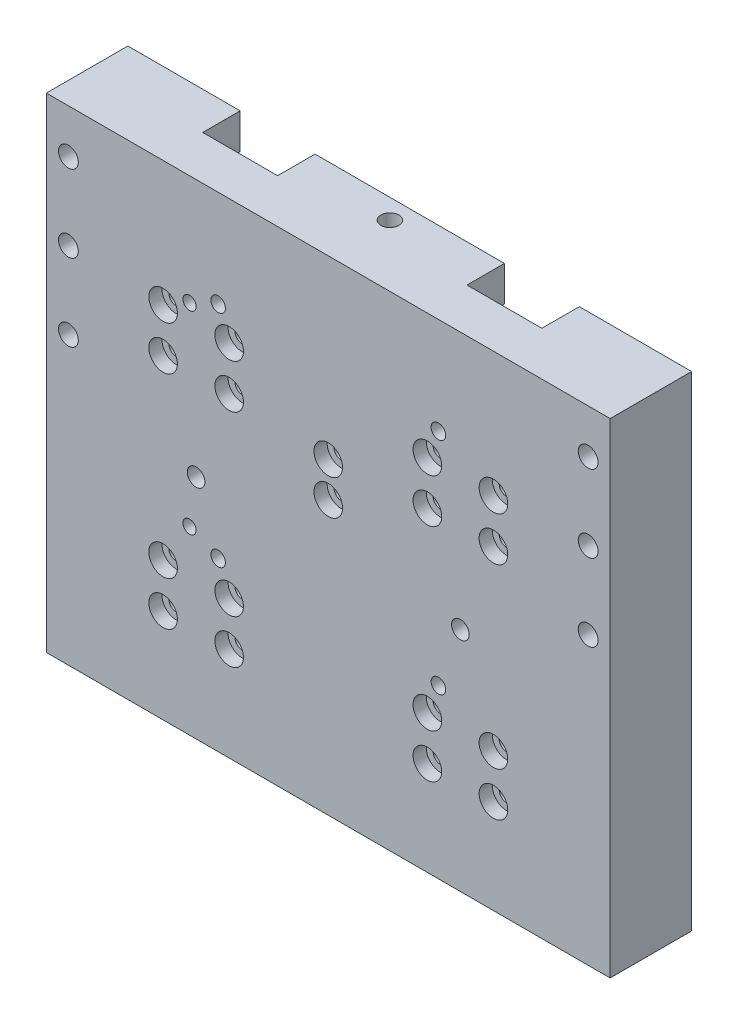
from build123d import *

# Parameters (mm, degrees)
SKETCH1_W                      = 128
SKETCH1_H                      = 110
BOSS_EXTRUDE1_DEPTH            = 18.5
SKETCH2_W                      = 98
SKETCH2_H                      = 99
CUT_EXTRUDE1_DEPTH             = 9.5
SKETCH4_W                      = 17
SKETCH4_H                      = 8.5
CUT_EXTRUDE2_DEPTH             = 129.601127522
CBORE_FOR_M4_SHCS0_D           = 4.5
CBORE_FOR_M4_SHCS0_CBORE_D     = 8
CBORE_FOR_M4_SHCS0_CBORE_DEPTH = 4
FILLET1_R                      = 4
M4X0_7_TAPPED_HOLE4_D          = 3.3
CBORE_FOR_M3_SHCS3_D           = 3.4
CBORE_FOR_M3_SHCS3_CBORE_D     = 6.5
CBORE_FOR_M3_SHCS3_CBORE_DEPTH = 3
CBORE_FOR_M3_SHCS4_D           = 3.4
CBORE_FOR_M3_SHCS4_CBORE_D     = 6.5
CBORE_FOR_M3_SHCS4_CBORE_DEPTH = 3
F_4_1_4_1_DIAMETER_HOLE1_D     = 4.1
F_4_1_4_1_DIAMETER_HOLE1_DEPTH = 8
F_3_0_3_DIAMETER_HOLE1_D       = 3
F_4_0_4_DIAMETER_HOLE1_D       = 4


with BuildPart() as part:
    # Sketch1 → Boss-Extrude1 (new body)
    with BuildSketch(Plane.XY):
        Rectangle(SKETCH1_W, SKETCH1_H)
    extrude(amount=BOSS_EXTRUDE1_DEPTH)

    # Sketch2 → Cut-Extrude1 (cut)
    with BuildSketch(Plane(origin=(0, 0, 0), x_dir=(-1, 0, 0), z_dir=(0, 0, -1))):
        with Locations((0, -2.5)):
            Rectangle(SKETCH2_W, SKETCH2_H)
    extrude(amount=-CUT_EXTRUDE1_DEPTH, mode=Mode.SUBTRACT)

    # Sketch4 → Cut-Extrude2 (cut, through all)
    with BuildSketch(Plane(origin=(0, 55, 0), x_dir=(1, 0, 0), z_dir=(0, 1, 0))):
        with Locations((-30, -4.25)):
            Rectangle(SKETCH4_W, SKETCH4_H)
        with Locations((30, -4.25)):
            Rectangle(SKETCH4_W, SKETCH4_H)
    extrude(amount=-CUT_EXTRUDE2_DEPTH, mode=Mode.SUBTRACT)

    # CBORE for M4 SHCS0 (through all)
    with Locations(Plane(origin=(0, 0, 0), x_dir=(-1, 0, 0), z_dir=(0, 0, -1))):
        with Locations((-59, 45), (-59, 27.5), (-59, 10)):
            cbore_for_m4_shcs0 = CounterBoreHole(CBORE_FOR_M4_SHCS0_D / 2, CBORE_FOR_M4_SHCS0_CBORE_D / 2, CBORE_FOR_M4_SHCS0_CBORE_DEPTH)

    # Mirror1: CBORE for M4 SHCS0 across plane
    add(cbore_for_m4_shcs0.mirror(Plane(origin=(0, 0, 0), x_dir=(0, 0, 1), z_dir=(1, 0, 0))), mode=Mode.SUBTRACT)

    # Fillet1
    fillet1_edges = [part.edges().sort_by_distance(p)[0] for p in [
        (49, -52, 4.75),
        (49, 47, 4.75),
        (-49, 47, 4.75),
        (-49, -52, 4.75),
    ]]
    fillet(fillet1_edges, radius=FILLET1_R)

    # M4x0.7 Tapped Hole4 (through all)
    with Locations(Plane.XY.offset(18.5)):
        with Locations((-25, 33), (25, 33), (25, -17), (-25, -17)):
            Hole(M4X0_7_TAPPED_HOLE4_D / 2)

    # CBORE for M3 SHCS3 (through all)
    with Locations(Plane.XY.offset(18.5)):
        with Locations((0, 15), (0, 7)):
            CounterBoreHole(CBORE_FOR_M3_SHCS3_D / 2, CBORE_FOR_M3_SHCS3_CBORE_D / 2, CBORE_FOR_M3_SHCS3_CBORE_DEPTH)

    # CBORE for M3 SHCS4 (through all)
    with Locations(Plane.XY.offset(18.5)):
        with Locations((-37.5, 26.6), (-37.5, 16.6), (-22.5, 26.6), (-22.5, 16.6), (-37.5, -23.6), (-37.5, -33.6), (-22.5, -33.6), (-22.5, -23.6), (22.5, -23.6), (22.5, -33.6), (37.5, -33.6), (37.5, -23.6), (37.5, 16.6), (37.5, 26.6), (22.5, 26.6), (22.5, 16.6)):
            CounterBoreHole(CBORE_FOR_M3_SHCS4_D / 2, CBORE_FOR_M3_SHCS4_CBORE_D / 2, CBORE_FOR_M3_SHCS4_CBORE_DEPTH)

    # 4.1 _4.1_ Diameter Hole1
    with Locations(Plane(origin=(0, 55, 0), x_dir=(1, 0, 0), z_dir=(0, 1, 0))):
        with Locations((0, -4.5)):
            Hole(F_4_1_4_1_DIAMETER_HOLE1_D / 2, depth=F_4_1_4_1_DIAMETER_HOLE1_DEPTH)

    # 3.0 _3_ Diameter Hole1 (through all)
    with Locations(Plane.XY.offset(18.5)):
        with Locations((-31.5, 30), (-31.5, -14)):
            Hole(F_3_0_3_DIAMETER_HOLE1_D / 2)

    # 4.0 _4_ Diameter Hole1 (through all)
    with Locations(Plane.XY.offset(18.5)):
        with Locations((-30, -3.5), (30, -3.5)):
            Hole(F_4_0_4_DIAMETER_HOLE1_D / 2)


solid = part.part
